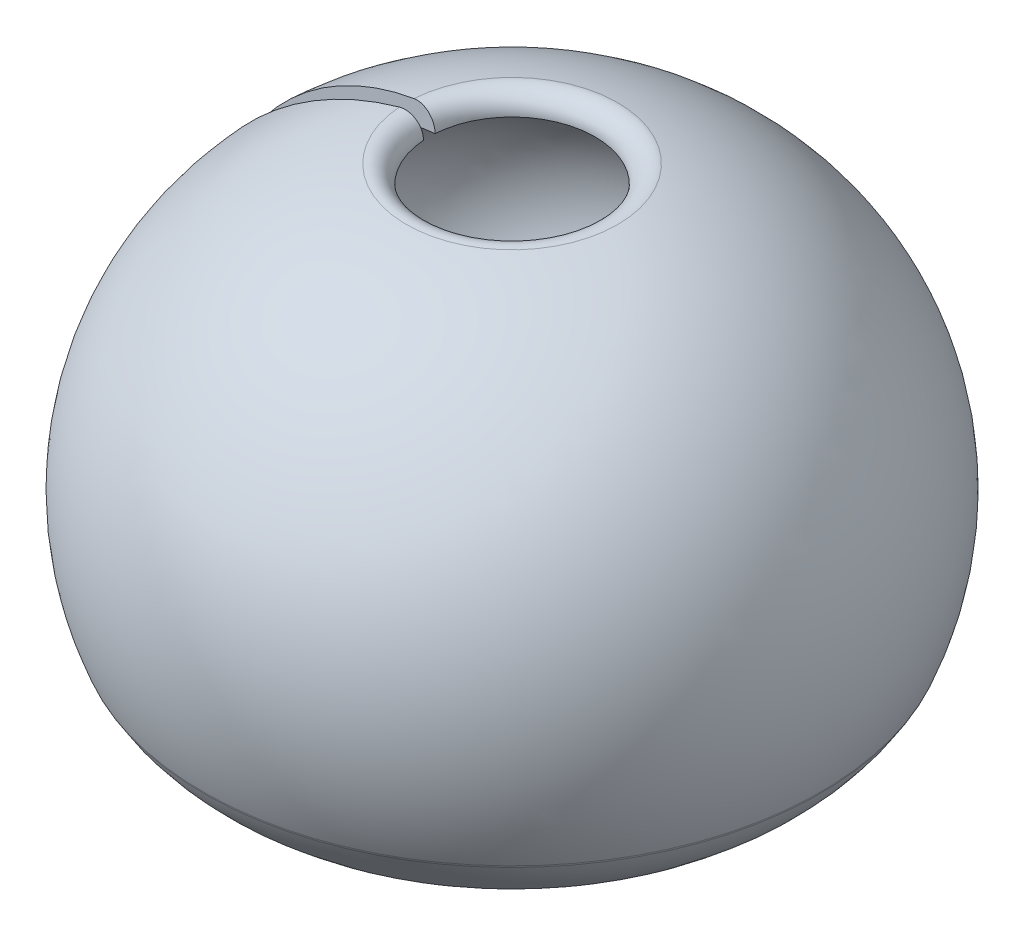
ISO-10303-21;
HEADER;
FILE_DESCRIPTION(('STEP AP214'),'2;1');
FILE_NAME('part.step','',(''),(''),'','','');
FILE_SCHEMA(('AUTOMOTIVE_DESIGN { 1 0 10303 214 1 1 1 1 }'));
ENDSEC;
DATA;
#1=APPLICATION_CONTEXT('core data for automotive mechanical design processes');
#2=APPLICATION_PROTOCOL_DEFINITION('international standard','automotive_design',2000,#1);
#3=PRODUCT_CONTEXT('',#1,'mechanical');
#4=PRODUCT('Part','Part','',(#3));
#5=PRODUCT_RELATED_PRODUCT_CATEGORY('part','',(#4));
#6=PRODUCT_DEFINITION_FORMATION('','',#4);
#7=PRODUCT_DEFINITION_CONTEXT('part definition',#1,'design');
#8=PRODUCT_DEFINITION('design','',#6,#7);
#9=PRODUCT_DEFINITION_SHAPE('','',#8);
#10=(LENGTH_UNIT() NAMED_UNIT(*) SI_UNIT(.MILLI.,.METRE.));
#11=(NAMED_UNIT(*) PLANE_ANGLE_UNIT() SI_UNIT($,.RADIAN.));
#12=(NAMED_UNIT(*) SI_UNIT($,.STERADIAN.) SOLID_ANGLE_UNIT());
#13=UNCERTAINTY_MEASURE_WITH_UNIT(LENGTH_MEASURE(1.E-05),#10,'distance_accuracy_value','');
#14=(GEOMETRIC_REPRESENTATION_CONTEXT(3) GLOBAL_UNCERTAINTY_ASSIGNED_CONTEXT((#13)) GLOBAL_UNIT_ASSIGNED_CONTEXT((#10,
#11,#12)) REPRESENTATION_CONTEXT('',''));
#15=CARTESIAN_POINT('',(0.,0.,0.));
#16=DIRECTION('',(0.,0.,1.));
#17=DIRECTION('',(1.,0.,0.));
#18=AXIS2_PLACEMENT_3D('',#15,#16,#17);
#19=CARTESIAN_POINT('',(0.,91.7869132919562,0.));
#20=DIRECTION('',(0.,-1.,0.));
#21=DIRECTION('',(0.,0.,-1.));
#22=AXIS2_PLACEMENT_3D('',#19,#20,#21);
#23=TOROIDAL_SURFACE('',#22,129.323578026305,56.9999999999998);
#24=CARTESIAN_POINT('',(0.,147.920955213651,0.));
#25=DIRECTION('',(0.,-1.,0.));
#26=DIRECTION('',(0.,0.,-1.));
#27=AXIS2_PLACEMENT_3D('',#24,#25,#26);
#28=CIRCLE('',#27,139.221524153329);
#29=CARTESIAN_POINT('',(-138.882387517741,147.920955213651,-9.71160259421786));
#30=VERTEX_POINT('',#29);
#31=CARTESIAN_POINT('',(-138.882387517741,147.920955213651,9.71160259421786));
#32=VERTEX_POINT('',#31);
#33=EDGE_CURVE('E11',#30,#32,#28,.T.);
#34=ORIENTED_EDGE('',*,*,#33,.F.);
#35=CARTESIAN_POINT('',(-129.008552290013,91.7869132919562,-9.0211567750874));
#36=DIRECTION('',(0.0697564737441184,0.,-0.997564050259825));
#37=DIRECTION('',(0.997564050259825,0.,0.0697564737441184));
#38=AXIS2_PLACEMENT_3D('',#35,#36,#37);
#39=CIRCLE('',#38,56.9999999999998);
#40=CARTESIAN_POINT('',(-78.1235122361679,66.3497022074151,-5.46292814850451));
#41=VERTEX_POINT('',#40);
#42=EDGE_CURVE('E108',#30,#41,#39,.T.);
#43=ORIENTED_EDGE('',*,*,#42,.T.);
#44=CARTESIAN_POINT('',(0.,66.3497022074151,0.));
#45=DIRECTION('',(0.,-1.,0.));
#46=DIRECTION('',(0.,0.,-1.));
#47=AXIS2_PLACEMENT_3D('',#44,#45,#46);
#48=CIRCLE('',#47,78.3142818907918);
#49=CARTESIAN_POINT('',(-78.1235122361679,66.3497022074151,5.46292814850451));
#50=VERTEX_POINT('',#49);
#51=EDGE_CURVE('E103',#41,#50,#48,.T.);
#52=ORIENTED_EDGE('',*,*,#51,.T.);
#53=CARTESIAN_POINT('',(-129.008552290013,91.7869132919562,9.0211567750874));
#54=DIRECTION('',(-0.0697564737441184,0.,-0.997564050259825));
#55=DIRECTION('',(0.997564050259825,0.,-0.0697564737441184));
#56=AXIS2_PLACEMENT_3D('',#53,#54,#55);
#57=CIRCLE('',#56,56.9999999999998);
#58=EDGE_CURVE('E106',#32,#50,#57,.T.);
#59=ORIENTED_EDGE('',*,*,#58,.F.);
#60=EDGE_LOOP('',(#34,#43,#52,#59));
#61=FACE_BOUND('',#60,.T.);
#62=ADVANCED_FACE('F37',(#61),#23,.T.);
#63=CARTESIAN_POINT('',(0.,385.,0.));
#64=DIRECTION('',(0.,-1.,0.));
#65=DIRECTION('',(0.,0.,-1.));
#66=AXIS2_PLACEMENT_3D('',#63,#64,#65);
#67=DEGENERATE_TOROIDAL_SURFACE('',#66,125.05,237.50222224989,.T.);
#68=CARTESIAN_POINT('',(0.,436.084382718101,0.));
#69=DIRECTION('',(0.,-1.,0.));
#70=DIRECTION('',(0.,0.,-1.));
#71=AXIS2_PLACEMENT_3D('',#68,#69,#70);
#72=CIRCLE('',#71,356.993293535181);
#73=CARTESIAN_POINT('',(-356.123675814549,436.084382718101,-24.9025933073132));
#74=VERTEX_POINT('',#73);
#75=CARTESIAN_POINT('',(-356.123675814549,436.084382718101,24.9025933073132));
#76=VERTEX_POINT('',#75);
#77=EDGE_CURVE('E45',#74,#76,#72,.T.);
#78=ORIENTED_EDGE('',*,*,#77,.F.);
#79=CARTESIAN_POINT('',(-124.745384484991,385.,-8.72304704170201));
#80=DIRECTION('',(-0.0697564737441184,0.,0.997564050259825));
#81=DIRECTION('',(-0.997564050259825,0.,-0.0697564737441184));
#82=AXIS2_PLACEMENT_3D('',#79,#80,#81);
#83=CIRCLE('',#82,237.50222224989);
#84=EDGE_CURVE('E113',#74,#30,#83,.T.);
#85=ORIENTED_EDGE('',*,*,#84,.T.);
#86=ORIENTED_EDGE('',*,*,#33,.T.);
#87=CARTESIAN_POINT('',(-124.745384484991,385.,8.72304704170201));
#88=DIRECTION('',(0.0697564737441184,0.,0.997564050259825));
#89=DIRECTION('',(-0.997564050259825,0.,0.0697564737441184));
#90=AXIS2_PLACEMENT_3D('',#87,#88,#89);
#91=CIRCLE('',#90,237.50222224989);
#92=EDGE_CURVE('E126',#76,#32,#91,.T.);
#93=ORIENTED_EDGE('',*,*,#92,.F.);
#94=EDGE_LOOP('',(#78,#85,#86,#93));
#95=FACE_BOUND('',#94,.T.);
#96=ADVANCED_FACE('F39',(#95),#67,.F.);
#97=CARTESIAN_POINT('',(0.,790.381139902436,0.));
#98=DIRECTION('',(0.,-1.,0.));
#99=DIRECTION('',(0.,0.,-1.));
#100=AXIS2_PLACEMENT_3D('',#97,#98,#99);
#101=DEGENERATE_TOROIDAL_SURFACE('',#100,160.516254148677,405.128892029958,.T.);
#102=CARTESIAN_POINT('',(0.,1151.3882200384,0.));
#103=DIRECTION('',(0.,-1.,0.));
#104=DIRECTION('',(0.,0.,-1.));
#105=AXIS2_PLACEMENT_3D('',#102,#103,#104);
#106=CIRCLE('',#105,344.373011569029);
#107=CARTESIAN_POINT('',(-343.534136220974,1151.3882200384,-24.022246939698));
#108=VERTEX_POINT('',#107);
#109=CARTESIAN_POINT('',(-343.534136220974,1151.3882200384,24.022246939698));
#110=VERTEX_POINT('',#109);
#111=EDGE_CURVE('E175',#108,#110,#106,.T.);
#112=ORIENTED_EDGE('',*,*,#111,.F.);
#113=CARTESIAN_POINT('',(-160.12524462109,790.381139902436,-11.1970478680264));
#114=DIRECTION('',(-0.0697564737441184,0.,0.997564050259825));
#115=DIRECTION('',(0.997564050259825,0.,0.0697564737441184));
#116=AXIS2_PLACEMENT_3D('',#113,#114,#115);
#117=CIRCLE('',#116,405.128892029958);
#118=EDGE_CURVE('E163',#108,#74,#117,.T.);
#119=ORIENTED_EDGE('',*,*,#118,.T.);
#120=ORIENTED_EDGE('',*,*,#77,.T.);
#121=CARTESIAN_POINT('',(-160.12524462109,790.381139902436,11.1970478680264));
#122=DIRECTION('',(0.0697564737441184,0.,0.997564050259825));
#123=DIRECTION('',(0.997564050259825,0.,-0.0697564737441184));
#124=AXIS2_PLACEMENT_3D('',#121,#122,#123);
#125=CIRCLE('',#124,405.128892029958);
#126=EDGE_CURVE('E142',#110,#76,#125,.T.);
#127=ORIENTED_EDGE('',*,*,#126,.F.);
#128=EDGE_LOOP('',(#112,#119,#120,#127));
#129=FACE_BOUND('',#128,.T.);
#130=ADVANCED_FACE('F178',(#129),#101,.F.);
#131=CARTESIAN_POINT('',(0.,1199.19244241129,0.));
#132=DIRECTION('',(0.,-1.,0.));
#133=DIRECTION('',(0.,0.,-1.));
#134=AXIS2_PLACEMENT_3D('',#131,#132,#133);
#135=TOROIDAL_SURFACE('',#134,313.328586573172,57.0000000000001);
#136=CARTESIAN_POINT('',(0.,1173.27857851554,0.));
#137=DIRECTION('',(0.,-1.,0.));
#138=DIRECTION('',(0.,0.,-1.));
#139=AXIS2_PLACEMENT_3D('',#136,#137,#138);
#140=CIRCLE('',#139,364.09739252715);
#141=CARTESIAN_POINT('',(-363.210469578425,1173.27857851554,-25.3981502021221));
#142=VERTEX_POINT('',#141);
#143=CARTESIAN_POINT('',(-363.210469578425,1173.27857851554,25.3981502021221));
#144=VERTEX_POINT('',#143);
#145=EDGE_CURVE('E173',#142,#144,#140,.T.);
#146=ORIENTED_EDGE('',*,*,#145,.F.);
#147=CARTESIAN_POINT('',(-312.56533388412,1199.19244241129,-21.8566973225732));
#148=DIRECTION('',(-0.0697564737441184,0.,0.997564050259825));
#149=DIRECTION('',(0.997564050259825,0.,0.0697564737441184));
#150=AXIS2_PLACEMENT_3D('',#147,#148,#149);
#151=CIRCLE('',#150,57.0000000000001);
#152=EDGE_CURVE('E160',#142,#108,#151,.T.);
#153=ORIENTED_EDGE('',*,*,#152,.T.);
#154=ORIENTED_EDGE('',*,*,#111,.T.);
#155=CARTESIAN_POINT('',(-312.56533388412,1199.19244241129,21.8566973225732));
#156=DIRECTION('',(0.0697564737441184,0.,0.997564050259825));
#157=DIRECTION('',(0.997564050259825,0.,-0.0697564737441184));
#158=AXIS2_PLACEMENT_3D('',#155,#156,#157);
#159=CIRCLE('',#158,57.0000000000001);
#160=EDGE_CURVE('E139',#144,#110,#159,.T.);
#161=ORIENTED_EDGE('',*,*,#160,.F.);
#162=EDGE_LOOP('',(#146,#153,#154,#161));
#163=FACE_BOUND('',#162,.T.);
#164=ADVANCED_FACE('F201',(#163),#135,.F.);
#165=CARTESIAN_POINT('',(0.,385.,0.));
#166=DIRECTION('',(0.,-1.,0.));
#167=DIRECTION('',(0.,0.,-1.));
#168=AXIS2_PLACEMENT_3D('',#165,#166,#167);
#169=DEGENERATE_TOROIDAL_SURFACE('',#168,125.05,823.727365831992,.T.);
#170=CARTESIAN_POINT('',(0.,1198.19765524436,0.));
#171=DIRECTION('',(0.,-1.,0.));
#172=DIRECTION('',(0.,0.,-1.));
#173=AXIS2_PLACEMENT_3D('',#170,#171,#172);
#174=CIRCLE('',#173,256.337267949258);
#175=CARTESIAN_POINT('',(-255.712843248,1198.19765524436,-17.8811839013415));
#176=VERTEX_POINT('',#175);
#177=CARTESIAN_POINT('',(-255.712843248,1198.19765524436,17.8811839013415));
#178=VERTEX_POINT('',#177);
#179=EDGE_CURVE('E171',#176,#178,#174,.T.);
#180=ORIENTED_EDGE('',*,*,#179,.F.);
#181=CARTESIAN_POINT('',(-124.745384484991,385.,-8.72304704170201));
#182=DIRECTION('',(-0.0697564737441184,0.,0.997564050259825));
#183=DIRECTION('',(0.997564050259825,0.,0.0697564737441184));
#184=AXIS2_PLACEMENT_3D('',#181,#182,#183);
#185=CIRCLE('',#184,823.727365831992);
#186=EDGE_CURVE('E157',#176,#142,#185,.T.);
#187=ORIENTED_EDGE('',*,*,#186,.T.);
#188=ORIENTED_EDGE('',*,*,#145,.T.);
#189=CARTESIAN_POINT('',(-124.745384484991,385.,8.72304704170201));
#190=DIRECTION('',(0.0697564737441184,0.,0.997564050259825));
#191=DIRECTION('',(0.997564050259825,0.,-0.0697564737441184));
#192=AXIS2_PLACEMENT_3D('',#189,#190,#191);
#193=CIRCLE('',#192,823.727365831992);
#194=EDGE_CURVE('E136',#178,#144,#193,.T.);
#195=ORIENTED_EDGE('',*,*,#194,.F.);
#196=EDGE_LOOP('',(#180,#187,#188,#195));
#197=FACE_BOUND('',#196,.T.);
#198=ADVANCED_FACE('F198',(#197),#169,.F.);
#199=CARTESIAN_POINT('',(0.,1199.19244241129,0.));
#200=DIRECTION('',(0.,-1.,0.));
#201=DIRECTION('',(0.,0.,-1.));
#202=AXIS2_PLACEMENT_3D('',#199,#200,#201);
#203=TOROIDAL_SURFACE('',#202,313.328586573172,57.);
#204=CARTESIAN_POINT('',(0.,1254.72693608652,0.));
#205=DIRECTION('',(0.,-1.,0.));
#206=DIRECTION('',(0.,0.,-1.));
#207=AXIS2_PLACEMENT_3D('',#204,#205,#206);
#208=CIRCLE('',#207,326.170705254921);
#209=CARTESIAN_POINT('',(-325.376169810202,1254.72693608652,-22.7525182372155));
#210=VERTEX_POINT('',#209);
#211=CARTESIAN_POINT('',(-325.376169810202,1254.72693608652,22.7525182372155));
#212=VERTEX_POINT('',#211);
#213=EDGE_CURVE('E169',#210,#212,#208,.T.);
#214=ORIENTED_EDGE('',*,*,#213,.F.);
#215=CARTESIAN_POINT('',(-312.56533388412,1199.19244241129,-21.8566973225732));
#216=DIRECTION('',(0.0697564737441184,0.,-0.997564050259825));
#217=DIRECTION('',(-0.997564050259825,0.,-0.0697564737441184));
#218=AXIS2_PLACEMENT_3D('',#215,#216,#217);
#219=CIRCLE('',#218,57.);
#220=EDGE_CURVE('E154',#210,#176,#219,.T.);
#221=ORIENTED_EDGE('',*,*,#220,.T.);
#222=ORIENTED_EDGE('',*,*,#179,.T.);
#223=CARTESIAN_POINT('',(-312.56533388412,1199.19244241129,21.8566973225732));
#224=DIRECTION('',(-0.0697564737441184,0.,-0.997564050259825));
#225=DIRECTION('',(-0.997564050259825,0.,0.0697564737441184));
#226=AXIS2_PLACEMENT_3D('',#223,#224,#225);
#227=CIRCLE('',#226,57.);
#228=EDGE_CURVE('E133',#212,#178,#227,.T.);
#229=ORIENTED_EDGE('',*,*,#228,.F.);
#230=EDGE_LOOP('',(#214,#221,#222,#229));
#231=FACE_BOUND('',#230,.T.);
#232=ADVANCED_FACE('F194',(#231),#203,.T.);
#233=CARTESIAN_POINT('',(0.,385.,0.));
#234=DIRECTION('',(0.,-1.,0.));
#235=DIRECTION('',(0.,0.,-1.));
#236=AXIS2_PLACEMENT_3D('',#233,#234,#235);
#237=DEGENERATE_TOROIDAL_SURFACE('',#236,125.05,892.678263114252,.T.);
#238=CARTESIAN_POINT('',(0.,50.3001563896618,0.));
#239=DIRECTION('',(0.,-1.,0.));
#240=DIRECTION('',(0.,0.,-1.));
#241=AXIS2_PLACEMENT_3D('',#238,#239,#240);
#242=CIRCLE('',#241,952.606944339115);
#243=CARTESIAN_POINT('',(-950.286441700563,50.3001563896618,-66.4505013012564));
#244=VERTEX_POINT('',#243);
#245=CARTESIAN_POINT('',(-950.286441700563,50.3001563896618,66.4505013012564));
#246=VERTEX_POINT('',#245);
#247=EDGE_CURVE('E167',#244,#246,#242,.T.);
#248=ORIENTED_EDGE('',*,*,#247,.F.);
#249=CARTESIAN_POINT('',(-124.745384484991,385.,-8.72304704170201));
#250=DIRECTION('',(0.0697564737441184,0.,-0.997564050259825));
#251=DIRECTION('',(-0.997564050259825,0.,-0.0697564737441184));
#252=AXIS2_PLACEMENT_3D('',#249,#250,#251);
#253=CIRCLE('',#252,892.678263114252);
#254=EDGE_CURVE('E151',#244,#210,#253,.T.);
#255=ORIENTED_EDGE('',*,*,#254,.T.);
#256=ORIENTED_EDGE('',*,*,#213,.T.);
#257=CARTESIAN_POINT('',(-124.745384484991,385.,8.72304704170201));
#258=DIRECTION('',(-0.0697564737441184,0.,-0.997564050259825));
#259=DIRECTION('',(-0.997564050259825,0.,0.0697564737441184));
#260=AXIS2_PLACEMENT_3D('',#257,#258,#259);
#261=CIRCLE('',#260,892.678263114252);
#262=EDGE_CURVE('E130',#246,#212,#261,.T.);
#263=ORIENTED_EDGE('',*,*,#262,.F.);
#264=EDGE_LOOP('',(#248,#255,#256,#263));
#265=FACE_BOUND('',#264,.T.);
#266=ADVANCED_FACE('F192',(#265),#237,.T.);
#267=CARTESIAN_POINT('',(0.,71.6716760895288,0.));
#268=DIRECTION('',(0.,-1.,0.));
#269=DIRECTION('',(0.,0.,-1.));
#270=AXIS2_PLACEMENT_3D('',#267,#268,#269);
#271=TOROIDAL_SURFACE('',#270,899.765122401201,57.);
#272=CARTESIAN_POINT('',(0.,43.6073609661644,0.));
#273=DIRECTION('',(0.,-1.,0.));
#274=DIRECTION('',(0.,0.,-1.));
#275=AXIS2_PLACEMENT_3D('',#272,#273,#274);
#276=CIRCLE('',#275,949.377562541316);
#277=CARTESIAN_POINT('',(-947.064926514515,43.6073609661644,-66.2252310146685));
#278=VERTEX_POINT('',#277);
#279=CARTESIAN_POINT('',(-947.064926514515,43.6073609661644,66.2252310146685));
#280=VERTEX_POINT('',#279);
#281=EDGE_CURVE('E112',#278,#280,#276,.T.);
#282=ORIENTED_EDGE('',*,*,#281,.F.);
#283=CARTESIAN_POINT('',(-897.573339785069,71.6716760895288,-62.7644421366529));
#284=DIRECTION('',(0.0697564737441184,0.,-0.997564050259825));
#285=DIRECTION('',(-0.997564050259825,0.,-0.0697564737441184));
#286=AXIS2_PLACEMENT_3D('',#283,#284,#285);
#287=CIRCLE('',#286,57.);
#288=EDGE_CURVE('E148',#278,#244,#287,.T.);
#289=ORIENTED_EDGE('',*,*,#288,.T.);
#290=ORIENTED_EDGE('',*,*,#247,.T.);
#291=CARTESIAN_POINT('',(-897.573339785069,71.6716760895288,62.7644421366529));
#292=DIRECTION('',(-0.0697564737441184,0.,-0.997564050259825));
#293=DIRECTION('',(-0.997564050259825,0.,0.0697564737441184));
#294=AXIS2_PLACEMENT_3D('',#291,#292,#293);
#295=CIRCLE('',#294,57.);
#296=EDGE_CURVE('E121',#280,#246,#295,.T.);
#297=ORIENTED_EDGE('',*,*,#296,.F.);
#298=EDGE_LOOP('',(#282,#289,#290,#297));
#299=FACE_BOUND('',#298,.T.);
#300=ADVANCED_FACE('F188',(#299),#271,.T.);
#301=CARTESIAN_POINT('',(0.,286.554812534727,0.));
#302=DIRECTION('',(0.,-1.,0.));
#303=DIRECTION('',(0.,0.,-1.));
#304=AXIS2_PLACEMENT_3D('',#301,#302,#303);
#305=TOROIDAL_SURFACE('',#304,519.892080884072,493.438185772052);
#306=CARTESIAN_POINT('',(-518.625649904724,286.554812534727,-36.2658382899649));
#307=DIRECTION('',(0.0697564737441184,0.,-0.997564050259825));
#308=DIRECTION('',(-0.997564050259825,0.,-0.0697564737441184));
#309=AXIS2_PLACEMENT_3D('',#306,#307,#308);
#310=CIRCLE('',#309,493.438185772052);
#311=EDGE_CURVE('E146',#41,#278,#310,.T.);
#312=ORIENTED_EDGE('',*,*,#311,.T.);
#313=ORIENTED_EDGE('',*,*,#281,.T.);
#314=CARTESIAN_POINT('',(-518.625649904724,286.554812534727,36.2658382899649));
#315=DIRECTION('',(-0.0697564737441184,0.,-0.997564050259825));
#316=DIRECTION('',(-0.997564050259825,0.,0.0697564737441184));
#317=AXIS2_PLACEMENT_3D('',#314,#315,#316);
#318=CIRCLE('',#317,493.438185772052);
#319=EDGE_CURVE('E116',#50,#280,#318,.T.);
#320=ORIENTED_EDGE('',*,*,#319,.F.);
#321=ORIENTED_EDGE('',*,*,#51,.F.);
#322=EDGE_LOOP('',(#312,#313,#320,#321));
#323=FACE_BOUND('',#322,.T.);
#324=ADVANCED_FACE('F117',(#323),#305,.T.);
#325=CARTESIAN_POINT('',(-126.876968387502,238.393456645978,-8.8721019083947));
#326=DIRECTION('',(-0.0697564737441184,0.,0.997564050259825));
#327=DIRECTION('',(0.997564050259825,0.,0.0697564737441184));
#328=AXIS2_PLACEMENT_3D('',#325,#326,#327);
#329=PLANE('',#328);
#330=ORIENTED_EDGE('',*,*,#42,.F.);
#331=ORIENTED_EDGE('',*,*,#84,.F.);
#332=ORIENTED_EDGE('',*,*,#118,.F.);
#333=ORIENTED_EDGE('',*,*,#152,.F.);
#334=ORIENTED_EDGE('',*,*,#186,.F.);
#335=ORIENTED_EDGE('',*,*,#220,.F.);
#336=ORIENTED_EDGE('',*,*,#254,.F.);
#337=ORIENTED_EDGE('',*,*,#288,.F.);
#338=ORIENTED_EDGE('',*,*,#311,.F.);
#339=EDGE_LOOP('',(#330,#331,#332,#333,#334,#335,#336,#337,#338));
#340=FACE_BOUND('',#339,.T.);
#341=ADVANCED_FACE('F183',(#340),#329,.T.);
#342=CARTESIAN_POINT('',(-126.876968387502,238.393456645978,8.87210190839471));
#343=DIRECTION('',(0.0697564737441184,0.,0.997564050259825));
#344=DIRECTION('',(0.997564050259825,0.,-0.0697564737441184));
#345=AXIS2_PLACEMENT_3D('',#342,#343,#344);
#346=PLANE('',#345);
#347=ORIENTED_EDGE('',*,*,#58,.T.);
#348=ORIENTED_EDGE('',*,*,#319,.T.);
#349=ORIENTED_EDGE('',*,*,#296,.T.);
#350=ORIENTED_EDGE('',*,*,#262,.T.);
#351=ORIENTED_EDGE('',*,*,#228,.T.);
#352=ORIENTED_EDGE('',*,*,#194,.T.);
#353=ORIENTED_EDGE('',*,*,#160,.T.);
#354=ORIENTED_EDGE('',*,*,#126,.T.);
#355=ORIENTED_EDGE('',*,*,#92,.T.);
#356=EDGE_LOOP('',(#347,#348,#349,#350,#351,#352,#353,#354,#355));
#357=FACE_BOUND('',#356,.T.);
#358=ADVANCED_FACE('F124',(#357),#346,.F.);
#359=CLOSED_SHELL('',(#62,#96,#130,#164,#198,#232,#266,#300,#324,#341,#358));
#360=MANIFOLD_SOLID_BREP('B2',#359);
#361=ADVANCED_BREP_SHAPE_REPRESENTATION('',(#18,#360),#14);
#362=SHAPE_DEFINITION_REPRESENTATION(#9,#361);
ENDSEC;
END-ISO-10303-21;
